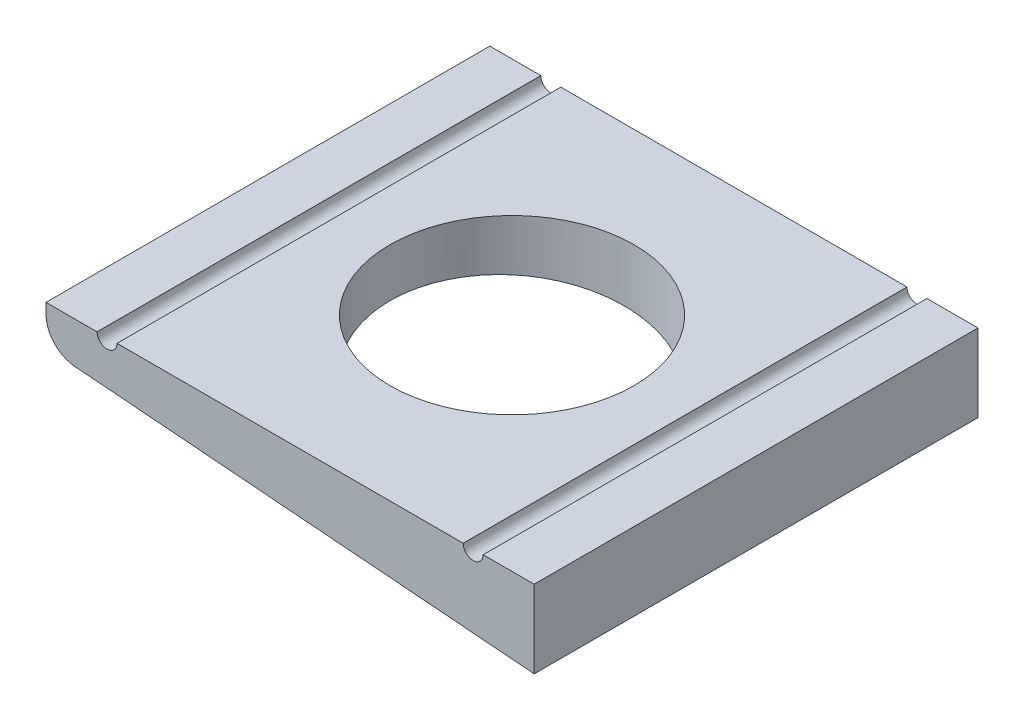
from build123d import *

# Parameters (mm, degrees)
BASE_EXTRUDE_DEPTH = 20
SKETCH2_R          = 11
CUT_EXTRUDE1_DEPTH = 31.545048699
SKETCH3_R          = 0.9
ID_GROOVES_DEPTH   = 47.184412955


with BuildPart() as part:
    # Sketch1 → Base-Extrude (new, symmetric)
    with BuildSketch(Plane.XY):
        with BuildLine():
            Line((22, 0), (-22, 0))
            Line((-22, 0), (-22, -0.91388277))
            ThreePointArc((-22, -0.91388277), (-21.256899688, -2.813662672), (-19.422025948, -3.705066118))
            Line((-19.422025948, -3.705066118), (22, -7))
            Line((22, -7), (22, 0))
        make_face()
    extrude(amount=BASE_EXTRUDE_DEPTH, both=True)

    # Sketch2 → Cut-Extrude1 (cut, through all)
    with BuildSketch(Plane(origin=(0, 0, 0), x_dir=(-1, 0, 0), z_dir=(0, 1, 0))):
        Circle(SKETCH2_R)
    extrude(amount=-CUT_EXTRUDE1_DEPTH, mode=Mode.SUBTRACT)

    # Sketch3 → ID-Grooves (cut, through all)
    with BuildSketch(Plane.XY.offset(20)):
        with Locations((16.5, 0)):
            Circle(SKETCH3_R)
        with Locations((-16.5, 0)):
            Circle(SKETCH3_R)
    extrude(amount=-ID_GROOVES_DEPTH, mode=Mode.SUBTRACT)


solid = part.part
